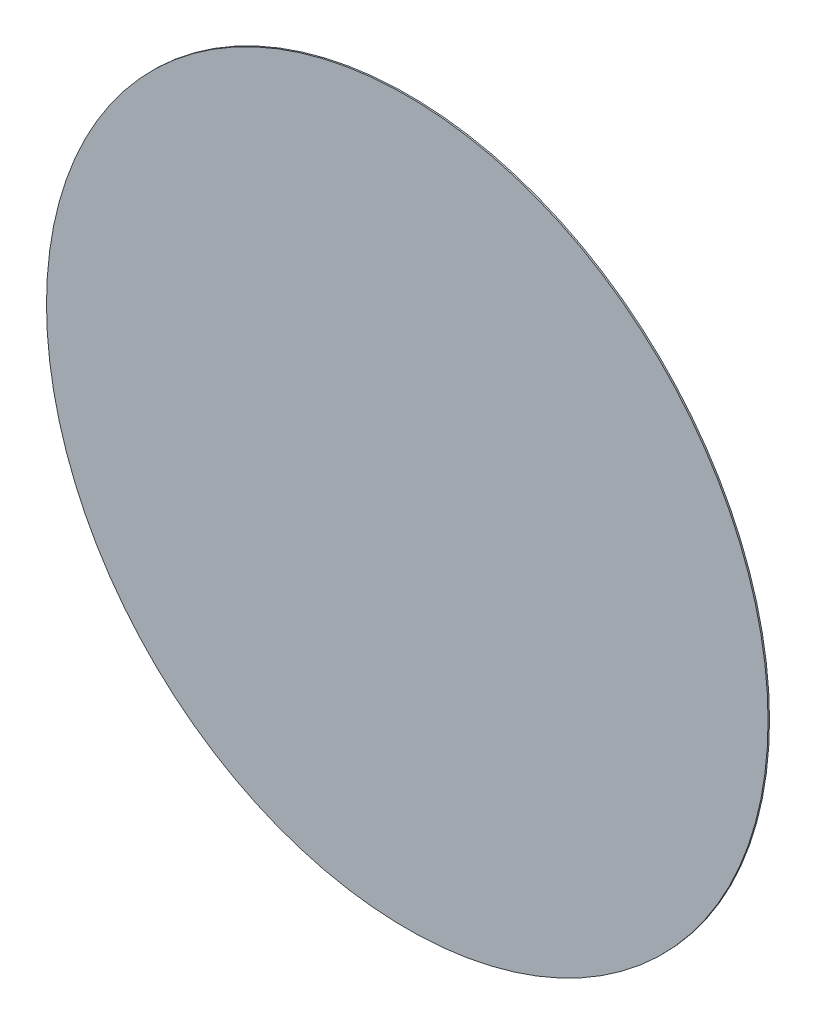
ISO-10303-21;
HEADER;
FILE_DESCRIPTION(('STEP AP214'),'2;1');
FILE_NAME('part.step','',(''),(''),'','','');
FILE_SCHEMA(('AUTOMOTIVE_DESIGN { 1 0 10303 214 1 1 1 1 }'));
ENDSEC;
DATA;
#1=APPLICATION_CONTEXT('core data for automotive mechanical design processes');
#2=APPLICATION_PROTOCOL_DEFINITION('international standard','automotive_design',2000,#1);
#3=PRODUCT_CONTEXT('',#1,'mechanical');
#4=PRODUCT('Part','Part','',(#3));
#5=PRODUCT_RELATED_PRODUCT_CATEGORY('part','',(#4));
#6=PRODUCT_DEFINITION_FORMATION('','',#4);
#7=PRODUCT_DEFINITION_CONTEXT('part definition',#1,'design');
#8=PRODUCT_DEFINITION('design','',#6,#7);
#9=PRODUCT_DEFINITION_SHAPE('','',#8);
#10=(LENGTH_UNIT() NAMED_UNIT(*) SI_UNIT(.MILLI.,.METRE.));
#11=(NAMED_UNIT(*) PLANE_ANGLE_UNIT() SI_UNIT($,.RADIAN.));
#12=(NAMED_UNIT(*) SI_UNIT($,.STERADIAN.) SOLID_ANGLE_UNIT());
#13=UNCERTAINTY_MEASURE_WITH_UNIT(LENGTH_MEASURE(1.E-05),#10,'distance_accuracy_value','');
#14=(GEOMETRIC_REPRESENTATION_CONTEXT(3) GLOBAL_UNCERTAINTY_ASSIGNED_CONTEXT((#13)) GLOBAL_UNIT_ASSIGNED_CONTEXT((#10,
#11,#12)) REPRESENTATION_CONTEXT('',''));
#15=CARTESIAN_POINT('',(0.,0.,0.));
#16=DIRECTION('',(0.,0.,1.));
#17=DIRECTION('',(1.,0.,0.));
#18=AXIS2_PLACEMENT_3D('',#15,#16,#17);
#19=CARTESIAN_POINT('',(0.,0.,0.05));
#20=DIRECTION('',(0.,0.,-1.));
#21=DIRECTION('',(-1.,0.,0.));
#22=AXIS2_PLACEMENT_3D('',#19,#20,#21);
#23=CYLINDRICAL_SURFACE('',#22,12.5);
#24=CARTESIAN_POINT('',(0.,0.,0.05));
#25=DIRECTION('',(0.,0.,1.));
#26=DIRECTION('',(1.,0.,0.));
#27=AXIS2_PLACEMENT_3D('',#24,#25,#26);
#28=CIRCLE('',#27,12.5);
#29=CARTESIAN_POINT('',(12.5,0.,0.05));
#30=VERTEX_POINT('',#29);
#31=EDGE_CURVE('E10',#30,#30,#28,.T.);
#32=ORIENTED_EDGE('',*,*,#31,.F.);
#33=EDGE_LOOP('',(#32));
#34=FACE_BOUND('',#33,.T.);
#35=CARTESIAN_POINT('',(0.,0.,0.));
#36=DIRECTION('',(0.,0.,1.));
#37=DIRECTION('',(1.,0.,0.));
#38=AXIS2_PLACEMENT_3D('',#35,#36,#37);
#39=CIRCLE('',#38,12.5);
#40=CARTESIAN_POINT('',(12.5,0.,0.));
#41=VERTEX_POINT('',#40);
#42=EDGE_CURVE('E34',#41,#41,#39,.T.);
#43=ORIENTED_EDGE('',*,*,#42,.T.);
#44=EDGE_LOOP('',(#43));
#45=FACE_BOUND('',#44,.T.);
#46=ADVANCED_FACE('F28',(#34,#45),#23,.T.);
#47=CARTESIAN_POINT('',(0.,0.,0.05));
#48=DIRECTION('',(0.,0.,1.));
#49=DIRECTION('',(1.,0.,0.));
#50=AXIS2_PLACEMENT_3D('',#47,#48,#49);
#51=PLANE('',#50);
#52=ORIENTED_EDGE('',*,*,#31,.T.);
#53=EDGE_LOOP('',(#52));
#54=FACE_BOUND('',#53,.T.);
#55=ADVANCED_FACE('F43',(#54),#51,.T.);
#56=CARTESIAN_POINT('',(0.,0.,0.));
#57=DIRECTION('',(0.,0.,1.));
#58=DIRECTION('',(1.,0.,0.));
#59=AXIS2_PLACEMENT_3D('',#56,#57,#58);
#60=PLANE('',#59);
#61=ORIENTED_EDGE('',*,*,#42,.F.);
#62=EDGE_LOOP('',(#61));
#63=FACE_BOUND('',#62,.T.);
#64=ADVANCED_FACE('F41',(#63),#60,.F.);
#65=CLOSED_SHELL('',(#46,#55,#64));
#66=MANIFOLD_SOLID_BREP('B2',#65);
#67=ADVANCED_BREP_SHAPE_REPRESENTATION('',(#18,#66),#14);
#68=SHAPE_DEFINITION_REPRESENTATION(#9,#67);
ENDSEC;
END-ISO-10303-21;
